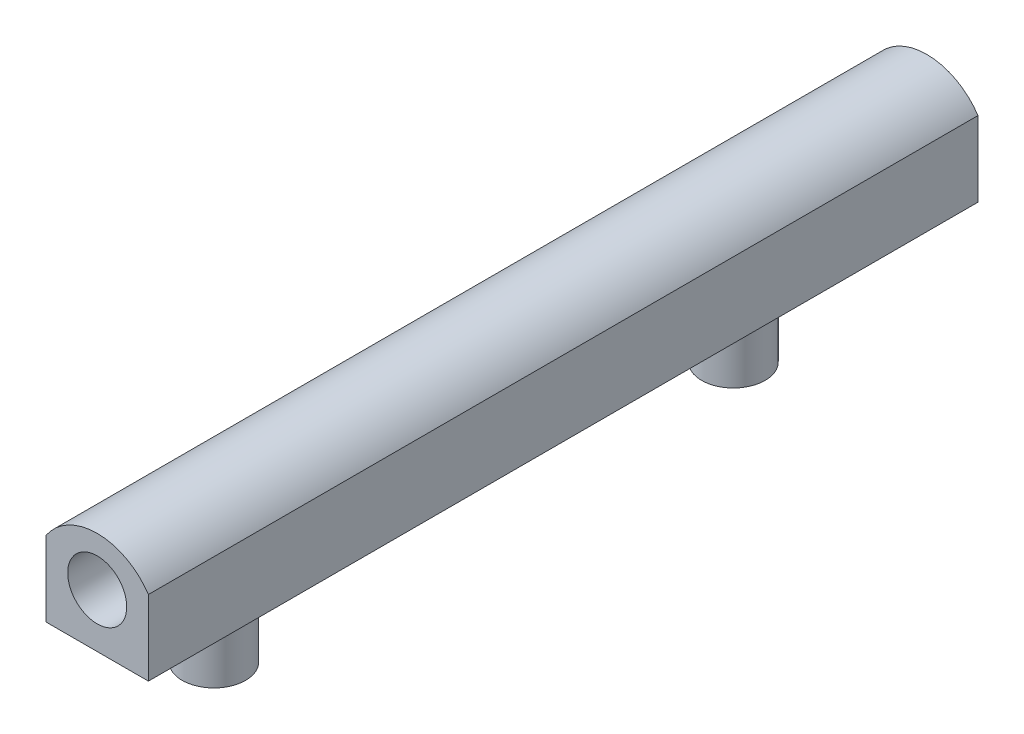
ISO-10303-21;
HEADER;
FILE_DESCRIPTION(('STEP AP214'),'2;1');
FILE_NAME('part.step','',(''),(''),'','','');
FILE_SCHEMA(('AUTOMOTIVE_DESIGN { 1 0 10303 214 1 1 1 1 }'));
ENDSEC;
DATA;
#1=APPLICATION_CONTEXT('core data for automotive mechanical design processes');
#2=APPLICATION_PROTOCOL_DEFINITION('international standard','automotive_design',2000,#1);
#3=PRODUCT_CONTEXT('',#1,'mechanical');
#4=PRODUCT('Part','Part','',(#3));
#5=PRODUCT_RELATED_PRODUCT_CATEGORY('part','',(#4));
#6=PRODUCT_DEFINITION_FORMATION('','',#4);
#7=PRODUCT_DEFINITION_CONTEXT('part definition',#1,'design');
#8=PRODUCT_DEFINITION('design','',#6,#7);
#9=PRODUCT_DEFINITION_SHAPE('','',#8);
#10=(LENGTH_UNIT() NAMED_UNIT(*) SI_UNIT(.MILLI.,.METRE.));
#11=(NAMED_UNIT(*) PLANE_ANGLE_UNIT() SI_UNIT($,.RADIAN.));
#12=(NAMED_UNIT(*) SI_UNIT($,.STERADIAN.) SOLID_ANGLE_UNIT());
#13=UNCERTAINTY_MEASURE_WITH_UNIT(LENGTH_MEASURE(1.E-05),#10,'distance_accuracy_value','');
#14=(GEOMETRIC_REPRESENTATION_CONTEXT(3) GLOBAL_UNCERTAINTY_ASSIGNED_CONTEXT((#13)) GLOBAL_UNIT_ASSIGNED_CONTEXT((#10,
#11,#12)) REPRESENTATION_CONTEXT('',''));
#15=CARTESIAN_POINT('',(0.,0.,0.));
#16=DIRECTION('',(0.,0.,1.));
#17=DIRECTION('',(1.,0.,0.));
#18=AXIS2_PLACEMENT_3D('',#15,#16,#17);
#19=CARTESIAN_POINT('',(-2.0066,-2.0955,-32.512));
#20=DIRECTION('',(0.,-1.,0.));
#21=DIRECTION('',(0.,0.,-1.));
#22=AXIS2_PLACEMENT_3D('',#19,#20,#21);
#23=PLANE('',#22);
#24=CARTESIAN_POINT('',(0.,-2.0955,-24.93264));
#25=DIRECTION('',(0.,-1.,0.));
#26=DIRECTION('',(0.,0.,-1.));
#27=AXIS2_PLACEMENT_3D('',#24,#25,#26);
#28=CIRCLE('',#27,1.6256);
#29=CARTESIAN_POINT('',(0.,-2.0955,-26.55824));
#30=VERTEX_POINT('',#29);
#31=EDGE_CURVE('E41',#30,#30,#28,.F.);
#32=ORIENTED_EDGE('',*,*,#31,.T.);
#33=EDGE_LOOP('',(#32));
#34=FACE_BOUND('',#33,.T.);
#35=CARTESIAN_POINT('',(0.,-2.0955,-4.572));
#36=DIRECTION('',(0.,-1.,0.));
#37=DIRECTION('',(0.,0.,-1.));
#38=AXIS2_PLACEMENT_3D('',#35,#36,#37);
#39=CIRCLE('',#38,1.6256);
#40=CARTESIAN_POINT('',(0.,-2.0955,-6.1976));
#41=VERTEX_POINT('',#40);
#42=EDGE_CURVE('E156',#41,#41,#39,.F.);
#43=ORIENTED_EDGE('',*,*,#42,.T.);
#44=EDGE_LOOP('',(#43));
#45=FACE_BOUND('',#44,.T.);
#46=DIRECTION('',(1.,0.,0.));
#47=VECTOR('',#46,1.);
#48=CARTESIAN_POINT('',(-2.0066,-2.0955,0.));
#49=LINE('',#48,#47);
#50=CARTESIAN_POINT('',(-2.0066,-2.0955,0.));
#51=VERTEX_POINT('',#50);
#52=CARTESIAN_POINT('',(2.0066,-2.0955,0.));
#53=VERTEX_POINT('',#52);
#54=EDGE_CURVE('E134',#51,#53,#49,.T.);
#55=ORIENTED_EDGE('',*,*,#54,.F.);
#56=DIRECTION('',(0.,0.,1.));
#57=VECTOR('',#56,1.);
#58=CARTESIAN_POINT('',(-2.0066,-2.0955,-32.512));
#59=LINE('',#58,#57);
#60=CARTESIAN_POINT('',(-2.0066,-2.0955,-32.512));
#61=VERTEX_POINT('',#60);
#62=EDGE_CURVE('E141',#61,#51,#59,.T.);
#63=ORIENTED_EDGE('',*,*,#62,.F.);
#64=DIRECTION('',(1.,0.,0.));
#65=VECTOR('',#64,1.);
#66=CARTESIAN_POINT('',(-2.0066,-2.0955,-32.512));
#67=LINE('',#66,#65);
#68=CARTESIAN_POINT('',(2.0066,-2.0955,-32.512));
#69=VERTEX_POINT('',#68);
#70=EDGE_CURVE('E125',#61,#69,#67,.T.);
#71=ORIENTED_EDGE('',*,*,#70,.T.);
#72=DIRECTION('',(0.,0.,1.));
#73=VECTOR('',#72,1.);
#74=CARTESIAN_POINT('',(2.0066,-2.0955,-32.512));
#75=LINE('',#74,#73);
#76=EDGE_CURVE('E67',#69,#53,#75,.T.);
#77=ORIENTED_EDGE('',*,*,#76,.T.);
#78=EDGE_LOOP('',(#55,#63,#71,#77));
#79=FACE_BOUND('',#78,.T.);
#80=ADVANCED_FACE('F32',(#34,#45,#79),#23,.T.);
#81=CARTESIAN_POINT('',(0.,-0.4953,-32.512));
#82=DIRECTION('',(0.,0.,-1.));
#83=DIRECTION('',(-1.,0.,0.));
#84=AXIS2_PLACEMENT_3D('',#81,#82,#83);
#85=PLANE('',#84);
#86=CARTESIAN_POINT('',(0.,-0.4953,-32.512));
#87=DIRECTION('',(0.,0.,1.));
#88=DIRECTION('',(-1.,0.,0.));
#89=AXIS2_PLACEMENT_3D('',#86,#87,#88);
#90=CIRCLE('',#89,2.413);
#91=CARTESIAN_POINT('',(2.0066,0.844896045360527,-32.512));
#92=VERTEX_POINT('',#91);
#93=CARTESIAN_POINT('',(-2.0066,0.844896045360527,-32.512));
#94=VERTEX_POINT('',#93);
#95=EDGE_CURVE('E120',#92,#94,#90,.T.);
#96=ORIENTED_EDGE('',*,*,#95,.F.);
#97=DIRECTION('',(0.,1.,0.));
#98=VECTOR('',#97,1.);
#99=CARTESIAN_POINT('',(2.0066,-2.0955,-32.512));
#100=LINE('',#99,#98);
#101=EDGE_CURVE('E127',#69,#92,#100,.T.);
#102=ORIENTED_EDGE('',*,*,#101,.F.);
#103=ORIENTED_EDGE('',*,*,#70,.F.);
#104=DIRECTION('',(0.,-1.,0.));
#105=VECTOR('',#104,1.);
#106=CARTESIAN_POINT('',(-2.0066,0.844896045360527,-32.512));
#107=LINE('',#106,#105);
#108=EDGE_CURVE('E122',#94,#61,#107,.T.);
#109=ORIENTED_EDGE('',*,*,#108,.F.);
#110=EDGE_LOOP('',(#96,#102,#103,#109));
#111=FACE_BOUND('',#110,.T.);
#112=CARTESIAN_POINT('',(0.,0.,-32.512));
#113=DIRECTION('',(0.,0.,-1.));
#114=DIRECTION('',(-1.,0.,0.));
#115=AXIS2_PLACEMENT_3D('',#112,#113,#114);
#116=CIRCLE('',#115,1.3843);
#117=CARTESIAN_POINT('',(-1.3843,0.,-32.512));
#118=VERTEX_POINT('',#117);
#119=EDGE_CURVE('E119',#118,#118,#116,.F.);
#120=ORIENTED_EDGE('',*,*,#119,.T.);
#121=EDGE_LOOP('',(#120));
#122=FACE_BOUND('',#121,.T.);
#123=ADVANCED_FACE('F187',(#111,#122),#85,.T.);
#124=CARTESIAN_POINT('',(0.,0.,-32.512));
#125=DIRECTION('',(0.,0.,1.));
#126=DIRECTION('',(1.,0.,0.));
#127=AXIS2_PLACEMENT_3D('',#124,#125,#126);
#128=CYLINDRICAL_SURFACE('',#127,1.1557);
#129=CARTESIAN_POINT('',(0.,0.,0.));
#130=DIRECTION('',(0.,0.,1.));
#131=DIRECTION('',(1.,0.,0.));
#132=AXIS2_PLACEMENT_3D('',#129,#130,#131);
#133=CIRCLE('',#132,1.1557);
#134=CARTESIAN_POINT('',(1.1557,0.,0.));
#135=VERTEX_POINT('',#134);
#136=EDGE_CURVE('E115',#135,#135,#133,.T.);
#137=ORIENTED_EDGE('',*,*,#136,.T.);
#138=EDGE_LOOP('',(#137));
#139=FACE_BOUND('',#138,.T.);
#140=CARTESIAN_POINT('',(0.,0.,-4.572));
#141=DIRECTION('',(0.,0.,-1.));
#142=DIRECTION('',(-1.,0.,0.));
#143=AXIS2_PLACEMENT_3D('',#140,#141,#142);
#144=CIRCLE('',#143,1.1557);
#145=CARTESIAN_POINT('',(-1.1557,0.,-4.572));
#146=VERTEX_POINT('',#145);
#147=EDGE_CURVE('E114',#146,#146,#144,.F.);
#148=ORIENTED_EDGE('',*,*,#147,.F.);
#149=EDGE_LOOP('',(#148));
#150=FACE_BOUND('',#149,.T.);
#151=ADVANCED_FACE('F192',(#139,#150),#128,.F.);
#152=CARTESIAN_POINT('',(0.,-0.4953,-32.512));
#153=DIRECTION('',(0.,0.,1.));
#154=DIRECTION('',(1.,0.,0.));
#155=AXIS2_PLACEMENT_3D('',#152,#153,#154);
#156=CYLINDRICAL_SURFACE('',#155,2.413);
#157=CARTESIAN_POINT('',(0.,-0.4953,0.));
#158=DIRECTION('',(0.,0.,1.));
#159=DIRECTION('',(-1.,0.,0.));
#160=AXIS2_PLACEMENT_3D('',#157,#158,#159);
#161=CIRCLE('',#160,2.413);
#162=CARTESIAN_POINT('',(2.0066,0.844896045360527,0.));
#163=VERTEX_POINT('',#162);
#164=CARTESIAN_POINT('',(-2.0066,0.844896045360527,0.));
#165=VERTEX_POINT('',#164);
#166=EDGE_CURVE('E118',#163,#165,#161,.T.);
#167=ORIENTED_EDGE('',*,*,#166,.F.);
#168=DIRECTION('',(0.,0.,1.));
#169=VECTOR('',#168,1.);
#170=CARTESIAN_POINT('',(2.0066,0.844896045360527,-32.512));
#171=LINE('',#170,#169);
#172=EDGE_CURVE('E49',#92,#163,#171,.T.);
#173=ORIENTED_EDGE('',*,*,#172,.F.);
#174=ORIENTED_EDGE('',*,*,#95,.T.);
#175=DIRECTION('',(0.,0.,1.));
#176=VECTOR('',#175,1.);
#177=CARTESIAN_POINT('',(-2.0066,0.844896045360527,-32.512));
#178=LINE('',#177,#176);
#179=EDGE_CURVE('E78',#94,#165,#178,.T.);
#180=ORIENTED_EDGE('',*,*,#179,.T.);
#181=EDGE_LOOP('',(#167,#173,#174,#180));
#182=FACE_BOUND('',#181,.T.);
#183=ADVANCED_FACE('F203',(#182),#156,.T.);
#184=CARTESIAN_POINT('',(2.0066,-2.0955,-32.512));
#185=DIRECTION('',(1.,0.,0.));
#186=DIRECTION('',(0.,1.,0.));
#187=AXIS2_PLACEMENT_3D('',#184,#185,#186);
#188=PLANE('',#187);
#189=DIRECTION('',(0.,1.,0.));
#190=VECTOR('',#189,1.);
#191=CARTESIAN_POINT('',(2.0066,-2.0955,0.));
#192=LINE('',#191,#190);
#193=EDGE_CURVE('E123',#53,#163,#192,.T.);
#194=ORIENTED_EDGE('',*,*,#193,.F.);
#195=ORIENTED_EDGE('',*,*,#76,.F.);
#196=ORIENTED_EDGE('',*,*,#101,.T.);
#197=ORIENTED_EDGE('',*,*,#172,.T.);
#198=EDGE_LOOP('',(#194,#195,#196,#197));
#199=FACE_BOUND('',#198,.T.);
#200=ADVANCED_FACE('F197',(#199),#188,.T.);
#201=CARTESIAN_POINT('',(-2.0066,0.844896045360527,-32.512));
#202=DIRECTION('',(-1.,0.,0.));
#203=DIRECTION('',(0.,-1.,0.));
#204=AXIS2_PLACEMENT_3D('',#201,#202,#203);
#205=PLANE('',#204);
#206=DIRECTION('',(0.,-1.,0.));
#207=VECTOR('',#206,1.);
#208=CARTESIAN_POINT('',(-2.0066,0.844896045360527,0.));
#209=LINE('',#208,#207);
#210=EDGE_CURVE('E131',#165,#51,#209,.T.);
#211=ORIENTED_EDGE('',*,*,#210,.F.);
#212=ORIENTED_EDGE('',*,*,#179,.F.);
#213=ORIENTED_EDGE('',*,*,#108,.T.);
#214=ORIENTED_EDGE('',*,*,#62,.T.);
#215=EDGE_LOOP('',(#211,#212,#213,#214));
#216=FACE_BOUND('',#215,.T.);
#217=ADVANCED_FACE('F199',(#216),#205,.T.);
#218=CARTESIAN_POINT('',(0.,-0.4953,0.));
#219=DIRECTION('',(0.,0.,-1.));
#220=DIRECTION('',(-1.,0.,0.));
#221=AXIS2_PLACEMENT_3D('',#218,#219,#220);
#222=PLANE('',#221);
#223=ORIENTED_EDGE('',*,*,#136,.F.);
#224=EDGE_LOOP('',(#223));
#225=FACE_BOUND('',#224,.T.);
#226=ORIENTED_EDGE('',*,*,#166,.T.);
#227=ORIENTED_EDGE('',*,*,#210,.T.);
#228=ORIENTED_EDGE('',*,*,#54,.T.);
#229=ORIENTED_EDGE('',*,*,#193,.T.);
#230=EDGE_LOOP('',(#226,#227,#228,#229));
#231=FACE_BOUND('',#230,.T.);
#232=ADVANCED_FACE('F202',(#225,#231),#222,.F.);
#233=CARTESIAN_POINT('',(0.,0.,-4.572));
#234=DIRECTION('',(0.,0.,-1.));
#235=DIRECTION('',(-1.,0.,0.));
#236=AXIS2_PLACEMENT_3D('',#233,#234,#235);
#237=PLANE('',#236);
#238=CARTESIAN_POINT('',(0.,0.,-4.572));
#239=DIRECTION('',(0.,0.,-1.));
#240=DIRECTION('',(-1.,0.,0.));
#241=AXIS2_PLACEMENT_3D('',#238,#239,#240);
#242=CIRCLE('',#241,1.2573);
#243=CARTESIAN_POINT('',(-1.2573,0.,-4.572));
#244=VERTEX_POINT('',#243);
#245=EDGE_CURVE('E139',#244,#244,#242,.T.);
#246=ORIENTED_EDGE('',*,*,#245,.T.);
#247=EDGE_LOOP('',(#246));
#248=FACE_BOUND('',#247,.T.);
#249=ORIENTED_EDGE('',*,*,#147,.T.);
#250=EDGE_LOOP('',(#249));
#251=FACE_BOUND('',#250,.T.);
#252=ADVANCED_FACE('F217',(#248,#251),#237,.T.);
#253=CARTESIAN_POINT('',(0.,0.,-37.084));
#254=DIRECTION('',(0.,0.,1.));
#255=DIRECTION('',(1.,0.,0.));
#256=AXIS2_PLACEMENT_3D('',#253,#254,#255);
#257=CYLINDRICAL_SURFACE('',#256,1.3843);
#258=CARTESIAN_POINT('',(0.,0.,-4.69899999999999));
#259=DIRECTION('',(0.,0.,-1.));
#260=DIRECTION('',(-1.,0.,0.));
#261=AXIS2_PLACEMENT_3D('',#258,#259,#260);
#262=CIRCLE('',#261,1.3843);
#263=CARTESIAN_POINT('',(-1.3843,0.,-4.69899999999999));
#264=VERTEX_POINT('',#263);
#265=EDGE_CURVE('E150',#264,#264,#262,.F.);
#266=ORIENTED_EDGE('',*,*,#265,.T.);
#267=EDGE_LOOP('',(#266));
#268=FACE_BOUND('',#267,.T.);
#269=ORIENTED_EDGE('',*,*,#119,.F.);
#270=EDGE_LOOP('',(#269));
#271=FACE_BOUND('',#270,.T.);
#272=ADVANCED_FACE('F209',(#268,#271),#257,.F.);
#273=CARTESIAN_POINT('',(0.,0.,-4.69899999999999));
#274=DIRECTION('',(0.,0.,-1.));
#275=DIRECTION('',(-1.,0.,0.));
#276=AXIS2_PLACEMENT_3D('',#273,#274,#275);
#277=TOROIDAL_SURFACE('',#276,1.2573,0.127);
#278=ORIENTED_EDGE('',*,*,#265,.F.);
#279=EDGE_LOOP('',(#278));
#280=FACE_BOUND('',#279,.T.);
#281=ORIENTED_EDGE('',*,*,#245,.F.);
#282=EDGE_LOOP('',(#281));
#283=FACE_BOUND('',#282,.T.);
#284=ADVANCED_FACE('F206',(#280,#283),#277,.F.);
#285=CARTESIAN_POINT('',(0.,-4.7371,-4.572));
#286=DIRECTION('',(0.,1.,0.));
#287=DIRECTION('',(0.,0.,1.));
#288=AXIS2_PLACEMENT_3D('',#285,#286,#287);
#289=CYLINDRICAL_SURFACE('',#288,1.2446);
#290=CARTESIAN_POINT('',(0.,-2.4765,-4.572));
#291=DIRECTION('',(0.,-1.,0.));
#292=DIRECTION('',(0.,0.,-1.));
#293=AXIS2_PLACEMENT_3D('',#290,#291,#292);
#294=CIRCLE('',#293,1.2446);
#295=CARTESIAN_POINT('',(0.,-2.4765,-5.8166));
#296=VERTEX_POINT('',#295);
#297=EDGE_CURVE('E11',#296,#296,#294,.T.);
#298=ORIENTED_EDGE('',*,*,#297,.T.);
#299=EDGE_LOOP('',(#298));
#300=FACE_BOUND('',#299,.T.);
#301=CARTESIAN_POINT('',(0.,-4.7371,-4.572));
#302=DIRECTION('',(0.,-1.,0.));
#303=DIRECTION('',(0.,0.,-1.));
#304=AXIS2_PLACEMENT_3D('',#301,#302,#303);
#305=CIRCLE('',#304,1.2446);
#306=CARTESIAN_POINT('',(0.,-4.7371,-5.8166));
#307=VERTEX_POINT('',#306);
#308=EDGE_CURVE('E111',#307,#307,#305,.T.);
#309=ORIENTED_EDGE('',*,*,#308,.F.);
#310=EDGE_LOOP('',(#309));
#311=FACE_BOUND('',#310,.T.);
#312=ADVANCED_FACE('F208',(#300,#311),#289,.T.);
#313=CARTESIAN_POINT('',(0.,-4.7371,-4.572));
#314=DIRECTION('',(0.,-1.,0.));
#315=DIRECTION('',(0.,0.,-1.));
#316=AXIS2_PLACEMENT_3D('',#313,#314,#315);
#317=PLANE('',#316);
#318=CARTESIAN_POINT('',(0.,-4.7371,-4.572));
#319=DIRECTION('',(0.,-1.,0.));
#320=DIRECTION('',(0.,0.,-1.));
#321=AXIS2_PLACEMENT_3D('',#318,#319,#320);
#322=CIRCLE('',#321,0.63499999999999);
#323=CARTESIAN_POINT('',(0.,-4.7371,-5.20699999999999));
#324=VERTEX_POINT('',#323);
#325=EDGE_CURVE('E97',#324,#324,#322,.T.);
#326=ORIENTED_EDGE('',*,*,#325,.F.);
#327=EDGE_LOOP('',(#326));
#328=FACE_BOUND('',#327,.T.);
#329=ORIENTED_EDGE('',*,*,#308,.T.);
#330=EDGE_LOOP('',(#329));
#331=FACE_BOUND('',#330,.T.);
#332=ADVANCED_FACE('F172',(#328,#331),#317,.T.);
#333=CARTESIAN_POINT('',(0.,-4.7371,-24.93264));
#334=DIRECTION('',(0.,1.,0.));
#335=DIRECTION('',(0.,0.,1.));
#336=AXIS2_PLACEMENT_3D('',#333,#334,#335);
#337=CYLINDRICAL_SURFACE('',#336,1.2446);
#338=CARTESIAN_POINT('',(0.,-2.4765,-24.93264));
#339=DIRECTION('',(0.,-1.,0.));
#340=DIRECTION('',(0.,0.,-1.));
#341=AXIS2_PLACEMENT_3D('',#338,#339,#340);
#342=CIRCLE('',#341,1.2446);
#343=CARTESIAN_POINT('',(0.,-2.4765,-26.17724));
#344=VERTEX_POINT('',#343);
#345=EDGE_CURVE('E153',#344,#344,#342,.T.);
#346=ORIENTED_EDGE('',*,*,#345,.T.);
#347=EDGE_LOOP('',(#346));
#348=FACE_BOUND('',#347,.T.);
#349=CARTESIAN_POINT('',(0.,-4.7371,-24.93264));
#350=DIRECTION('',(0.,-1.,0.));
#351=DIRECTION('',(0.,0.,-1.));
#352=AXIS2_PLACEMENT_3D('',#349,#350,#351);
#353=CIRCLE('',#352,1.2446);
#354=CARTESIAN_POINT('',(0.,-4.7371,-26.17724));
#355=VERTEX_POINT('',#354);
#356=EDGE_CURVE('E108',#355,#355,#353,.T.);
#357=ORIENTED_EDGE('',*,*,#356,.F.);
#358=EDGE_LOOP('',(#357));
#359=FACE_BOUND('',#358,.T.);
#360=ADVANCED_FACE('F168',(#348,#359),#337,.T.);
#361=CARTESIAN_POINT('',(0.,-4.7371,-24.93264));
#362=DIRECTION('',(0.,-1.,0.));
#363=DIRECTION('',(0.,0.,-1.));
#364=AXIS2_PLACEMENT_3D('',#361,#362,#363);
#365=PLANE('',#364);
#366=CARTESIAN_POINT('',(0.,-4.7371,-24.93264));
#367=DIRECTION('',(0.,-1.,0.));
#368=DIRECTION('',(0.,0.,-1.));
#369=AXIS2_PLACEMENT_3D('',#366,#367,#368);
#370=CIRCLE('',#369,0.63499999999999);
#371=CARTESIAN_POINT('',(0.,-4.7371,-25.56764));
#372=VERTEX_POINT('',#371);
#373=EDGE_CURVE('E98',#372,#372,#370,.T.);
#374=ORIENTED_EDGE('',*,*,#373,.F.);
#375=EDGE_LOOP('',(#374));
#376=FACE_BOUND('',#375,.T.);
#377=ORIENTED_EDGE('',*,*,#356,.T.);
#378=EDGE_LOOP('',(#377));
#379=FACE_BOUND('',#378,.T.);
#380=ADVANCED_FACE('F171',(#376,#379),#365,.T.);
#381=CARTESIAN_POINT('',(0.,-3.2131,-4.572));
#382=DIRECTION('',(0.,-1.,0.));
#383=DIRECTION('',(0.,0.,-1.));
#384=AXIS2_PLACEMENT_3D('',#381,#382,#383);
#385=CONICAL_SURFACE('',#384,0.634999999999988,1.02974425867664);
#386=CARTESIAN_POINT('',(0.,-2.8315535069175,-4.572));
#387=VERTEX_POINT('',#386);
#388=VERTEX_LOOP('',#387);
#389=FACE_BOUND('',#388,.T.);
#390=CARTESIAN_POINT('',(0.,-3.2131,-4.572));
#391=DIRECTION('',(0.,-1.,0.));
#392=DIRECTION('',(0.,0.,-1.));
#393=AXIS2_PLACEMENT_3D('',#390,#391,#392);
#394=CIRCLE('',#393,0.634999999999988);
#395=CARTESIAN_POINT('',(0.,-3.2131,-5.20699999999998));
#396=VERTEX_POINT('',#395);
#397=EDGE_CURVE('E101',#396,#396,#394,.T.);
#398=ORIENTED_EDGE('',*,*,#397,.T.);
#399=EDGE_LOOP('',(#398));
#400=FACE_BOUND('',#399,.T.);
#401=ADVANCED_FACE('F177',(#389,#400),#385,.F.);
#402=CARTESIAN_POINT('',(0.,-4.7371,-4.572));
#403=DIRECTION('',(0.,-1.,0.));
#404=DIRECTION('',(0.,0.,-1.));
#405=AXIS2_PLACEMENT_3D('',#402,#403,#404);
#406=CYLINDRICAL_SURFACE('',#405,0.634999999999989);
#407=ORIENTED_EDGE('',*,*,#397,.F.);
#408=EDGE_LOOP('',(#407));
#409=FACE_BOUND('',#408,.T.);
#410=ORIENTED_EDGE('',*,*,#325,.T.);
#411=EDGE_LOOP('',(#410));
#412=FACE_BOUND('',#411,.T.);
#413=ADVANCED_FACE('F91',(#409,#412),#406,.F.);
#414=CARTESIAN_POINT('',(0.,-3.2131,-24.93264));
#415=DIRECTION('',(0.,-1.,0.));
#416=DIRECTION('',(0.,0.,-1.));
#417=AXIS2_PLACEMENT_3D('',#414,#415,#416);
#418=CONICAL_SURFACE('',#417,0.634999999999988,1.02974425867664);
#419=CARTESIAN_POINT('',(0.,-2.8315535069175,-24.93264));
#420=VERTEX_POINT('',#419);
#421=VERTEX_LOOP('',#420);
#422=FACE_BOUND('',#421,.T.);
#423=CARTESIAN_POINT('',(0.,-3.2131,-24.93264));
#424=DIRECTION('',(0.,-1.,0.));
#425=DIRECTION('',(0.,0.,-1.));
#426=AXIS2_PLACEMENT_3D('',#423,#424,#425);
#427=CIRCLE('',#426,0.634999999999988);
#428=CARTESIAN_POINT('',(0.,-3.2131,-25.56764));
#429=VERTEX_POINT('',#428);
#430=EDGE_CURVE('E95',#429,#429,#427,.T.);
#431=ORIENTED_EDGE('',*,*,#430,.T.);
#432=EDGE_LOOP('',(#431));
#433=FACE_BOUND('',#432,.T.);
#434=ADVANCED_FACE('F87',(#422,#433),#418,.F.);
#435=CARTESIAN_POINT('',(0.,-4.7371,-24.93264));
#436=DIRECTION('',(0.,-1.,0.));
#437=DIRECTION('',(0.,0.,-1.));
#438=AXIS2_PLACEMENT_3D('',#435,#436,#437);
#439=CYLINDRICAL_SURFACE('',#438,0.634999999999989);
#440=ORIENTED_EDGE('',*,*,#430,.F.);
#441=EDGE_LOOP('',(#440));
#442=FACE_BOUND('',#441,.T.);
#443=ORIENTED_EDGE('',*,*,#373,.T.);
#444=EDGE_LOOP('',(#443));
#445=FACE_BOUND('',#444,.T.);
#446=ADVANCED_FACE('F90',(#442,#445),#439,.F.);
#447=CARTESIAN_POINT('',(0.,-2.4765,-24.93264));
#448=DIRECTION('',(0.,-1.,0.));
#449=DIRECTION('',(0.,0.,-1.));
#450=AXIS2_PLACEMENT_3D('',#447,#448,#449);
#451=TOROIDAL_SURFACE('',#450,1.6256,0.381);
#452=ORIENTED_EDGE('',*,*,#31,.F.);
#453=EDGE_LOOP('',(#452));
#454=FACE_BOUND('',#453,.T.);
#455=ORIENTED_EDGE('',*,*,#345,.F.);
#456=EDGE_LOOP('',(#455));
#457=FACE_BOUND('',#456,.T.);
#458=ADVANCED_FACE('F163',(#454,#457),#451,.F.);
#459=CARTESIAN_POINT('',(0.,-2.4765,-4.572));
#460=DIRECTION('',(0.,-1.,0.));
#461=DIRECTION('',(0.,0.,-1.));
#462=AXIS2_PLACEMENT_3D('',#459,#460,#461);
#463=TOROIDAL_SURFACE('',#462,1.6256,0.381);
#464=ORIENTED_EDGE('',*,*,#42,.F.);
#465=EDGE_LOOP('',(#464));
#466=FACE_BOUND('',#465,.T.);
#467=ORIENTED_EDGE('',*,*,#297,.F.);
#468=EDGE_LOOP('',(#467));
#469=FACE_BOUND('',#468,.T.);
#470=ADVANCED_FACE('F34',(#466,#469),#463,.F.);
#471=CLOSED_SHELL('',(#80,#123,#151,#183,#200,#217,#232,#252,#272,#284,#312,#332,#360,#380,#401,
#413,#434,#446,#458,#470));
#472=MANIFOLD_SOLID_BREP('B2',#471);
#473=ADVANCED_BREP_SHAPE_REPRESENTATION('',(#18,#472),#14);
#474=SHAPE_DEFINITION_REPRESENTATION(#9,#473);
ENDSEC;
END-ISO-10303-21;
